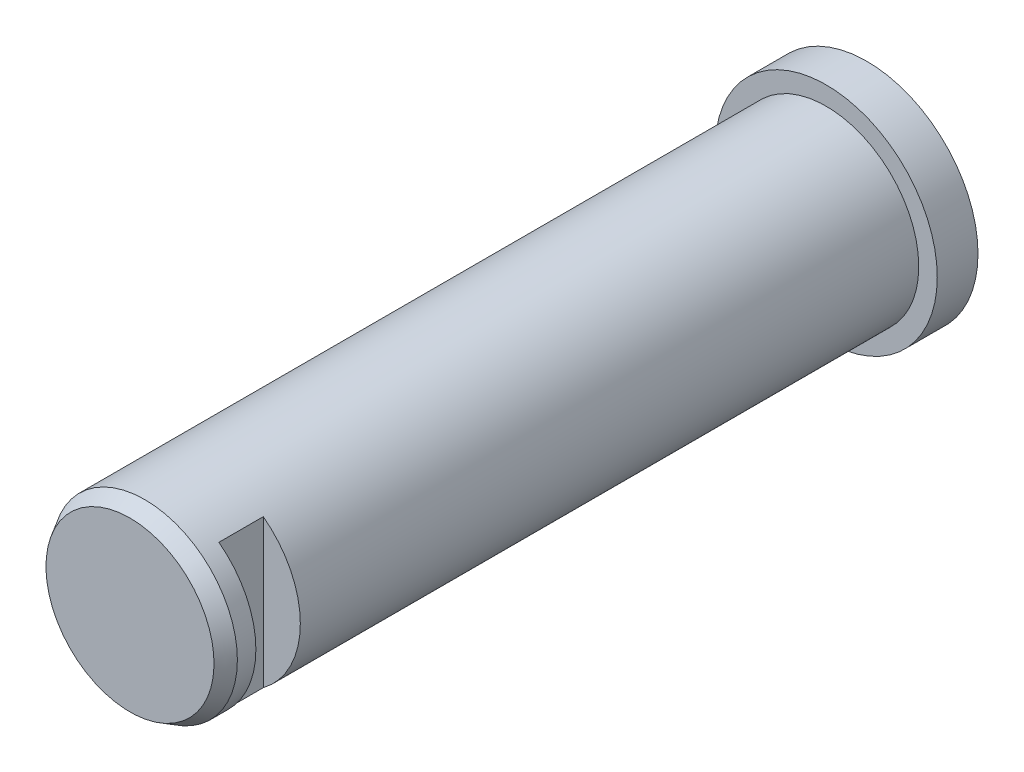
ISO-10303-21;
HEADER;
FILE_DESCRIPTION(('STEP AP214'),'2;1');
FILE_NAME('part.step','',(''),(''),'','','');
FILE_SCHEMA(('AUTOMOTIVE_DESIGN { 1 0 10303 214 1 1 1 1 }'));
ENDSEC;
DATA;
#1=APPLICATION_CONTEXT('core data for automotive mechanical design processes');
#2=APPLICATION_PROTOCOL_DEFINITION('international standard','automotive_design',2000,#1);
#3=PRODUCT_CONTEXT('',#1,'mechanical');
#4=PRODUCT('Part','Part','',(#3));
#5=PRODUCT_RELATED_PRODUCT_CATEGORY('part','',(#4));
#6=PRODUCT_DEFINITION_FORMATION('','',#4);
#7=PRODUCT_DEFINITION_CONTEXT('part definition',#1,'design');
#8=PRODUCT_DEFINITION('design','',#6,#7);
#9=PRODUCT_DEFINITION_SHAPE('','',#8);
#10=(LENGTH_UNIT() NAMED_UNIT(*) SI_UNIT(.MILLI.,.METRE.));
#11=(NAMED_UNIT(*) PLANE_ANGLE_UNIT() SI_UNIT($,.RADIAN.));
#12=(NAMED_UNIT(*) SI_UNIT($,.STERADIAN.) SOLID_ANGLE_UNIT());
#13=UNCERTAINTY_MEASURE_WITH_UNIT(LENGTH_MEASURE(1.E-05),#10,'distance_accuracy_value','');
#14=(GEOMETRIC_REPRESENTATION_CONTEXT(3) GLOBAL_UNCERTAINTY_ASSIGNED_CONTEXT((#13)) GLOBAL_UNIT_ASSIGNED_CONTEXT((#10,
#11,#12)) REPRESENTATION_CONTEXT('',''));
#15=CARTESIAN_POINT('',(0.,0.,0.));
#16=DIRECTION('',(0.,0.,1.));
#17=DIRECTION('',(1.,0.,0.));
#18=AXIS2_PLACEMENT_3D('',#15,#16,#17);
#19=CARTESIAN_POINT('',(0.,0.,-49.75));
#20=DIRECTION('',(0.,0.,1.));
#21=DIRECTION('',(1.,0.,0.));
#22=AXIS2_PLACEMENT_3D('',#19,#20,#21);
#23=PLANE('',#22);
#24=CARTESIAN_POINT('',(0.,0.,-49.75));
#25=DIRECTION('',(0.,0.,1.));
#26=DIRECTION('',(1.,0.,0.));
#27=AXIS2_PLACEMENT_3D('',#24,#25,#26);
#28=CIRCLE('',#27,15.);
#29=CARTESIAN_POINT('',(15.,0.,-49.75));
#30=VERTEX_POINT('',#29);
#31=EDGE_CURVE('E19',#30,#30,#28,.T.);
#32=ORIENTED_EDGE('',*,*,#31,.F.);
#33=EDGE_LOOP('',(#32));
#34=FACE_BOUND('',#33,.T.);
#35=ADVANCED_FACE('F16',(#34),#23,.F.);
#36=CARTESIAN_POINT('',(0.,0.,-49.75));
#37=DIRECTION('',(0.,0.,1.));
#38=DIRECTION('',(1.,0.,0.));
#39=AXIS2_PLACEMENT_3D('',#36,#37,#38);
#40=CYLINDRICAL_SURFACE('',#39,15.);
#41=ORIENTED_EDGE('',*,*,#31,.T.);
#42=EDGE_LOOP('',(#41));
#43=FACE_BOUND('',#42,.T.);
#44=CARTESIAN_POINT('',(0.,0.,-44.25));
#45=DIRECTION('',(0.,0.,1.));
#46=DIRECTION('',(1.,0.,0.));
#47=AXIS2_PLACEMENT_3D('',#44,#45,#46);
#48=CIRCLE('',#47,15.);
#49=CARTESIAN_POINT('',(15.,0.,-44.25));
#50=VERTEX_POINT('',#49);
#51=EDGE_CURVE('E48',#50,#50,#48,.T.);
#52=ORIENTED_EDGE('',*,*,#51,.F.);
#53=EDGE_LOOP('',(#52));
#54=FACE_BOUND('',#53,.T.);
#55=ADVANCED_FACE('F71',(#43,#54),#40,.T.);
#56=CARTESIAN_POINT('',(0.,0.,49.75));
#57=DIRECTION('',(0.,0.,1.));
#58=DIRECTION('',(1.,0.,0.));
#59=AXIS2_PLACEMENT_3D('',#56,#57,#58);
#60=PLANE('',#59);
#61=CARTESIAN_POINT('',(0.,0.,49.7499999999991));
#62=DIRECTION('',(0.,0.,-1.));
#63=DIRECTION('',(0.,1.,0.));
#64=AXIS2_PLACEMENT_3D('',#61,#62,#63);
#65=CIRCLE('',#64,11.3452994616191);
#66=CARTESIAN_POINT('',(0.,11.3452994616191,49.7499999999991));
#67=VERTEX_POINT('',#66);
#68=EDGE_CURVE('E59',#67,#67,#65,.T.);
#69=ORIENTED_EDGE('',*,*,#68,.F.);
#70=EDGE_LOOP('',(#69));
#71=FACE_BOUND('',#70,.T.);
#72=ADVANCED_FACE('F73',(#71),#60,.T.);
#73=CARTESIAN_POINT('',(12.5,-20.3076257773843,45.25));
#74=DIRECTION('',(0.,0.,1.));
#75=DIRECTION('',(1.,0.,0.));
#76=AXIS2_PLACEMENT_3D('',#73,#74,#75);
#77=PLANE('',#76);
#78=DIRECTION('',(0.,1.,0.));
#79=VECTOR('',#78,1.);
#80=CARTESIAN_POINT('',(7.5,4.69237422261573,45.25));
#81=LINE('',#80,#79);
#82=CARTESIAN_POINT('',(7.5,-10.,45.25));
#83=VERTEX_POINT('',#82);
#84=CARTESIAN_POINT('',(7.5,10.,45.25));
#85=VERTEX_POINT('',#84);
#86=EDGE_CURVE('E43',#83,#85,#81,.T.);
#87=ORIENTED_EDGE('',*,*,#86,.T.);
#88=CARTESIAN_POINT('',(0.,0.,45.25));
#89=DIRECTION('',(0.,0.,1.));
#90=DIRECTION('',(1.,0.,0.));
#91=AXIS2_PLACEMENT_3D('',#88,#89,#90);
#92=CIRCLE('',#91,12.5);
#93=EDGE_CURVE('E41',#83,#85,#92,.T.);
#94=ORIENTED_EDGE('',*,*,#93,.F.);
#95=EDGE_LOOP('',(#87,#94));
#96=FACE_BOUND('',#95,.T.);
#97=ADVANCED_FACE('F45',(#96),#77,.F.);
#98=CARTESIAN_POINT('',(12.5,29.6923742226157,39.25));
#99=DIRECTION('',(0.,0.,-1.));
#100=DIRECTION('',(0.,1.,0.));
#101=AXIS2_PLACEMENT_3D('',#98,#99,#100);
#102=PLANE('',#101);
#103=DIRECTION('',(0.,1.,0.));
#104=VECTOR('',#103,1.);
#105=CARTESIAN_POINT('',(7.5,4.69237422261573,39.25));
#106=LINE('',#105,#104);
#107=CARTESIAN_POINT('',(7.5,10.,39.25));
#108=VERTEX_POINT('',#107);
#109=CARTESIAN_POINT('',(7.5,-10.,39.25));
#110=VERTEX_POINT('',#109);
#111=EDGE_CURVE('E33',#108,#110,#106,.F.);
#112=ORIENTED_EDGE('',*,*,#111,.T.);
#113=CARTESIAN_POINT('',(0.,0.,39.25));
#114=DIRECTION('',(0.,0.,1.));
#115=DIRECTION('',(1.,0.,0.));
#116=AXIS2_PLACEMENT_3D('',#113,#114,#115);
#117=CIRCLE('',#116,12.5);
#118=EDGE_CURVE('E55',#108,#110,#117,.F.);
#119=ORIENTED_EDGE('',*,*,#118,.F.);
#120=EDGE_LOOP('',(#112,#119));
#121=FACE_BOUND('',#120,.T.);
#122=ADVANCED_FACE('F99',(#121),#102,.F.);
#123=CARTESIAN_POINT('',(7.5,4.69237422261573,42.25));
#124=DIRECTION('',(-1.,0.,0.));
#125=DIRECTION('',(0.,0.,1.));
#126=AXIS2_PLACEMENT_3D('',#123,#124,#125);
#127=PLANE('',#126);
#128=ORIENTED_EDGE('',*,*,#86,.F.);
#129=DIRECTION('',(0.,0.,1.));
#130=VECTOR('',#129,1.);
#131=CARTESIAN_POINT('',(7.5,-10.,0.));
#132=LINE('',#131,#130);
#133=EDGE_CURVE('E58',#110,#83,#132,.T.);
#134=ORIENTED_EDGE('',*,*,#133,.F.);
#135=ORIENTED_EDGE('',*,*,#111,.F.);
#136=DIRECTION('',(0.,0.,1.));
#137=VECTOR('',#136,1.);
#138=CARTESIAN_POINT('',(7.5,10.,0.));
#139=LINE('',#138,#137);
#140=EDGE_CURVE('E51',#85,#108,#139,.F.);
#141=ORIENTED_EDGE('',*,*,#140,.F.);
#142=EDGE_LOOP('',(#128,#134,#135,#141));
#143=FACE_BOUND('',#142,.T.);
#144=ADVANCED_FACE('F52',(#143),#127,.F.);
#145=CARTESIAN_POINT('',(0.,0.,-44.25));
#146=DIRECTION('',(0.,0.,1.));
#147=DIRECTION('',(1.,0.,0.));
#148=AXIS2_PLACEMENT_3D('',#145,#146,#147);
#149=PLANE('',#148);
#150=ORIENTED_EDGE('',*,*,#51,.T.);
#151=EDGE_LOOP('',(#150));
#152=FACE_BOUND('',#151,.T.);
#153=CARTESIAN_POINT('',(0.,0.,-44.25));
#154=DIRECTION('',(0.,0.,1.));
#155=DIRECTION('',(1.,0.,0.));
#156=AXIS2_PLACEMENT_3D('',#153,#154,#155);
#157=CIRCLE('',#156,12.5);
#158=CARTESIAN_POINT('',(12.5,0.,-44.25));
#159=VERTEX_POINT('',#158);
#160=EDGE_CURVE('E25',#159,#159,#157,.T.);
#161=ORIENTED_EDGE('',*,*,#160,.F.);
#162=EDGE_LOOP('',(#161));
#163=FACE_BOUND('',#162,.T.);
#164=ADVANCED_FACE('F68',(#152,#163),#149,.T.);
#165=CARTESIAN_POINT('',(0.,0.,47.750000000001));
#166=DIRECTION('',(0.,0.,-1.));
#167=DIRECTION('',(0.,1.,0.));
#168=AXIS2_PLACEMENT_3D('',#165,#166,#167);
#169=CONICAL_SURFACE('',#168,12.5000000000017,0.5235987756);
#170=ORIENTED_EDGE('',*,*,#68,.T.);
#171=EDGE_LOOP('',(#170));
#172=FACE_BOUND('',#171,.T.);
#173=CARTESIAN_POINT('',(0.,0.,47.75));
#174=DIRECTION('',(0.,0.,1.));
#175=DIRECTION('',(1.,0.,0.));
#176=AXIS2_PLACEMENT_3D('',#173,#174,#175);
#177=CIRCLE('',#176,12.5);
#178=CARTESIAN_POINT('',(12.5,0.,47.75));
#179=VERTEX_POINT('',#178);
#180=EDGE_CURVE('E11',#179,#179,#177,.F.);
#181=ORIENTED_EDGE('',*,*,#180,.F.);
#182=EDGE_LOOP('',(#181));
#183=FACE_BOUND('',#182,.T.);
#184=ADVANCED_FACE('F85',(#172,#183),#169,.T.);
#185=CARTESIAN_POINT('',(0.,0.,0.));
#186=DIRECTION('',(0.,0.,1.));
#187=DIRECTION('',(1.,0.,0.));
#188=AXIS2_PLACEMENT_3D('',#185,#186,#187);
#189=CYLINDRICAL_SURFACE('',#188,12.5);
#190=ORIENTED_EDGE('',*,*,#180,.T.);
#191=EDGE_LOOP('',(#190));
#192=FACE_BOUND('',#191,.T.);
#193=ORIENTED_EDGE('',*,*,#160,.T.);
#194=EDGE_LOOP('',(#193));
#195=FACE_BOUND('',#194,.T.);
#196=ORIENTED_EDGE('',*,*,#118,.T.);
#197=ORIENTED_EDGE('',*,*,#133,.T.);
#198=ORIENTED_EDGE('',*,*,#93,.T.);
#199=ORIENTED_EDGE('',*,*,#140,.T.);
#200=EDGE_LOOP('',(#196,#197,#198,#199));
#201=FACE_BOUND('',#200,.T.);
#202=ADVANCED_FACE('F57',(#192,#195,#201),#189,.T.);
#203=CLOSED_SHELL('',(#35,#55,#72,#97,#122,#144,#164,#184,#202));
#204=MANIFOLD_SOLID_BREP('B1',#203);
#205=ADVANCED_BREP_SHAPE_REPRESENTATION('',(#18,#204),#14);
#206=SHAPE_DEFINITION_REPRESENTATION(#9,#205);
ENDSEC;
END-ISO-10303-21;
